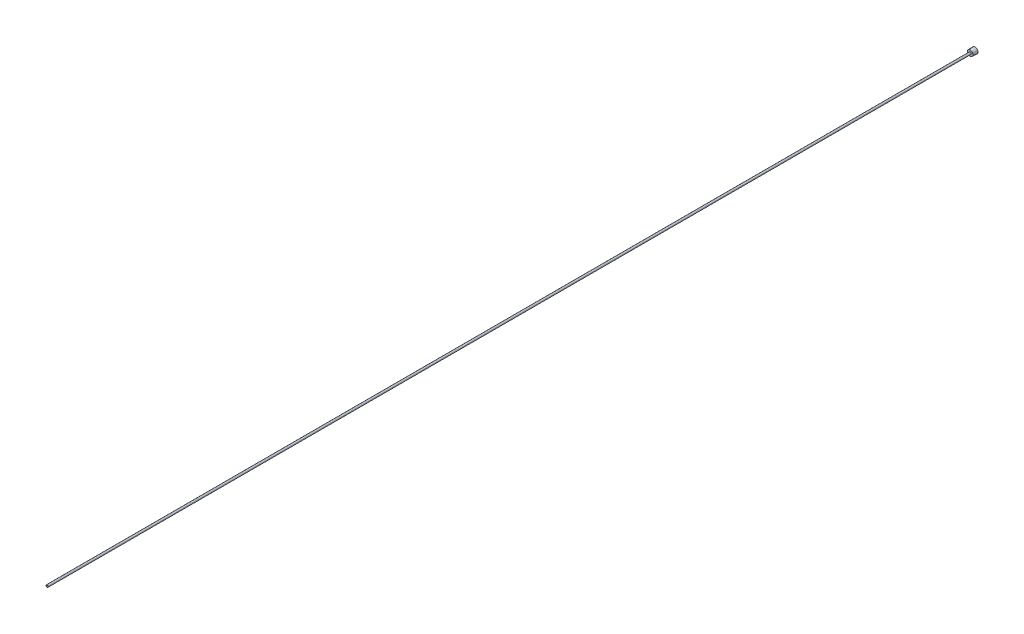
ISO-10303-21;
HEADER;
FILE_DESCRIPTION(('STEP AP214'),'2;1');
FILE_NAME('part.step','',(''),(''),'','','');
FILE_SCHEMA(('AUTOMOTIVE_DESIGN { 1 0 10303 214 1 1 1 1 }'));
ENDSEC;
DATA;
#1=APPLICATION_CONTEXT('core data for automotive mechanical design processes');
#2=APPLICATION_PROTOCOL_DEFINITION('international standard','automotive_design',2000,#1);
#3=PRODUCT_CONTEXT('',#1,'mechanical');
#4=PRODUCT('Part','Part','',(#3));
#5=PRODUCT_RELATED_PRODUCT_CATEGORY('part','',(#4));
#6=PRODUCT_DEFINITION_FORMATION('','',#4);
#7=PRODUCT_DEFINITION_CONTEXT('part definition',#1,'design');
#8=PRODUCT_DEFINITION('design','',#6,#7);
#9=PRODUCT_DEFINITION_SHAPE('','',#8);
#10=(LENGTH_UNIT() NAMED_UNIT(*) SI_UNIT(.MILLI.,.METRE.));
#11=(NAMED_UNIT(*) PLANE_ANGLE_UNIT() SI_UNIT($,.RADIAN.));
#12=(NAMED_UNIT(*) SI_UNIT($,.STERADIAN.) SOLID_ANGLE_UNIT());
#13=UNCERTAINTY_MEASURE_WITH_UNIT(LENGTH_MEASURE(1.E-05),#10,'distance_accuracy_value','');
#14=(GEOMETRIC_REPRESENTATION_CONTEXT(3) GLOBAL_UNCERTAINTY_ASSIGNED_CONTEXT((#13)) GLOBAL_UNIT_ASSIGNED_CONTEXT((#10,
#11,#12)) REPRESENTATION_CONTEXT('',''));
#15=CARTESIAN_POINT('',(0.,0.,0.));
#16=DIRECTION('',(0.,0.,1.));
#17=DIRECTION('',(1.,0.,0.));
#18=AXIS2_PLACEMENT_3D('',#15,#16,#17);
#19=CARTESIAN_POINT('',(0.,0.,0.));
#20=DIRECTION('',(0.,0.,1.));
#21=DIRECTION('',(1.,0.,0.));
#22=AXIS2_PLACEMENT_3D('',#19,#20,#21);
#23=CYLINDRICAL_SURFACE('',#22,1.2065);
#24=CARTESIAN_POINT('',(0.,0.,1219.2));
#25=DIRECTION('',(0.,0.,1.));
#26=DIRECTION('',(1.,0.,0.));
#27=AXIS2_PLACEMENT_3D('',#24,#25,#26);
#28=CIRCLE('',#27,1.2065);
#29=CARTESIAN_POINT('',(1.2065,0.,1219.2));
#30=VERTEX_POINT('',#29);
#31=EDGE_CURVE('E142',#30,#30,#28,.T.);
#32=CARTESIAN_POINT('',(0.,0.,3.96875));
#33=DIRECTION('',(0.,0.,-1.));
#34=DIRECTION('',(-1.,0.,0.));
#35=AXIS2_PLACEMENT_3D('',#32,#33,#34);
#36=CIRCLE('',#35,1.2065);
#37=CARTESIAN_POINT('',(1.2065,0.,3.96875));
#38=VERTEX_POINT('',#37);
#39=EDGE_CURVE('E37',#38,#38,#36,.F.);
#40=CARTESIAN_POINT('',(1.2065,0.,1219.2));
#41=CARTESIAN_POINT('',(1.2065,0.,1206.54134114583));
#42=CARTESIAN_POINT('',(1.2065,0.,1193.88268229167));
#43=CARTESIAN_POINT('',(1.2065,0.,1168.56536458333));
#44=CARTESIAN_POINT('',(1.2065,0.,1155.90670572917));
#45=CARTESIAN_POINT('',(1.2065,0.,1130.58938802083));
#46=CARTESIAN_POINT('',(1.2065,0.,1117.93072916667));
#47=CARTESIAN_POINT('',(1.2065,0.,1092.61341145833));
#48=CARTESIAN_POINT('',(1.2065,0.,1079.95475260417));
#49=CARTESIAN_POINT('',(1.2065,0.,1054.63743489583));
#50=CARTESIAN_POINT('',(1.2065,0.,1041.97877604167));
#51=CARTESIAN_POINT('',(1.2065,0.,1016.66145833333));
#52=CARTESIAN_POINT('',(1.2065,0.,1004.00279947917));
#53=CARTESIAN_POINT('',(1.2065,0.,978.685481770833));
#54=CARTESIAN_POINT('',(1.2065,0.,966.026822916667));
#55=CARTESIAN_POINT('',(1.2065,0.,940.709505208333));
#56=CARTESIAN_POINT('',(1.2065,0.,928.050846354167));
#57=CARTESIAN_POINT('',(1.2065,0.,902.733528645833));
#58=CARTESIAN_POINT('',(1.2065,0.,890.074869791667));
#59=CARTESIAN_POINT('',(1.2065,0.,864.757552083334));
#60=CARTESIAN_POINT('',(1.2065,0.,852.098893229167));
#61=CARTESIAN_POINT('',(1.2065,0.,826.781575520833));
#62=CARTESIAN_POINT('',(1.2065,0.,814.122916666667));
#63=CARTESIAN_POINT('',(1.2065,0.,788.805598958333));
#64=CARTESIAN_POINT('',(1.2065,0.,776.146940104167));
#65=CARTESIAN_POINT('',(1.2065,0.,750.829622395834));
#66=CARTESIAN_POINT('',(1.2065,0.,738.170963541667));
#67=CARTESIAN_POINT('',(1.2065,0.,712.853645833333));
#68=CARTESIAN_POINT('',(1.2065,0.,700.194986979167));
#69=CARTESIAN_POINT('',(1.2065,0.,674.877669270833));
#70=CARTESIAN_POINT('',(1.2065,0.,662.219010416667));
#71=CARTESIAN_POINT('',(1.2065,0.,636.901692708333));
#72=CARTESIAN_POINT('',(1.2065,0.,624.243033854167));
#73=CARTESIAN_POINT('',(1.2065,0.,598.925716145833));
#74=CARTESIAN_POINT('',(1.2065,0.,586.267057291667));
#75=CARTESIAN_POINT('',(1.2065,0.,560.949739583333));
#76=CARTESIAN_POINT('',(1.2065,0.,548.291080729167));
#77=CARTESIAN_POINT('',(1.2065,0.,522.973763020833));
#78=CARTESIAN_POINT('',(1.2065,0.,510.315104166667));
#79=CARTESIAN_POINT('',(1.2065,0.,484.997786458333));
#80=CARTESIAN_POINT('',(1.2065,0.,472.339127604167));
#81=CARTESIAN_POINT('',(1.2065,0.,447.021809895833));
#82=CARTESIAN_POINT('',(1.2065,0.,434.363151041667));
#83=CARTESIAN_POINT('',(1.2065,0.,409.045833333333));
#84=CARTESIAN_POINT('',(1.2065,0.,396.387174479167));
#85=CARTESIAN_POINT('',(1.2065,0.,371.069856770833));
#86=CARTESIAN_POINT('',(1.2065,0.,358.411197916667));
#87=CARTESIAN_POINT('',(1.2065,0.,333.093880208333));
#88=CARTESIAN_POINT('',(1.2065,0.,320.435221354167));
#89=CARTESIAN_POINT('',(1.2065,0.,295.117903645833));
#90=CARTESIAN_POINT('',(1.2065,0.,282.459244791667));
#91=CARTESIAN_POINT('',(1.2065,0.,257.141927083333));
#92=CARTESIAN_POINT('',(1.2065,0.,244.483268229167));
#93=CARTESIAN_POINT('',(1.2065,0.,219.165950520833));
#94=CARTESIAN_POINT('',(1.2065,0.,206.507291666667));
#95=CARTESIAN_POINT('',(1.2065,0.,181.189973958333));
#96=CARTESIAN_POINT('',(1.2065,0.,168.531315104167));
#97=CARTESIAN_POINT('',(1.2065,0.,143.213997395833));
#98=CARTESIAN_POINT('',(1.2065,0.,130.555338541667));
#99=CARTESIAN_POINT('',(1.2065,0.,105.238020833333));
#100=CARTESIAN_POINT('',(1.2065,0.,92.5793619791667));
#101=CARTESIAN_POINT('',(1.2065,0.,67.2620442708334));
#102=CARTESIAN_POINT('',(1.2065,0.,54.6033854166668));
#103=CARTESIAN_POINT('',(1.2065,0.,29.2860677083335));
#104=CARTESIAN_POINT('',(1.2065,0.,16.6274088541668));
#105=CARTESIAN_POINT('',(1.2065,0.,3.96875000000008));
#106=B_SPLINE_CURVE_WITH_KNOTS('',3,(#40,#41,#42,#43,#44,#45,#46,#47,#48,#49,#50,#51,#52,#53,
#54,#55,#56,#57,#58,#59,#60,#61,#62,#63,#64,#65,#66,#67,#68,#69,#70,#71,#72,#73,#74,#75,#76,#77,
#78,#79,#80,#81,#82,#83,#84,#85,#86,#87,#88,#89,#90,#91,#92,#93,#94,#95,#96,#97,#98,#99,#100,
#101,#102,#103,#104,#105),.UNSPECIFIED.,.F.,.F.,(4,2,2,2,2,2,2,2,2,2,2,2,2,2,2,2,2,2,2,2,2,2,2,
2,2,2,2,2,2,2,2,2,4),(0.,37.9759765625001,75.9519531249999,113.9279296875,151.90390625,
189.8798828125,227.855859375,265.8318359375,303.8078125,341.7837890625,379.759765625,
417.7357421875,455.71171875,493.6876953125,531.663671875,569.6396484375,607.615625,
645.5916015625,683.567578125,721.5435546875,759.51953125,797.4955078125,835.471484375,
873.4474609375,911.4234375,949.3994140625,987.375390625,1025.3513671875,1063.32734375,
1101.3033203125,1139.279296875,1177.2552734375,1215.23125),.UNSPECIFIED.);
#107=EDGE_CURVE('BSEAM33',#30,#38,#106,.T.);
#108=ORIENTED_EDGE('',*,*,#31,.T.);
#109=ORIENTED_EDGE('',*,*,#39,.F.);
#110=ORIENTED_EDGE('',*,*,#107,.T.);
#111=ORIENTED_EDGE('',*,*,#107,.F.);
#112=EDGE_LOOP('',(#108,#110,#109,#111));
#113=FACE_BOUND('',#112,.T.);
#114=ADVANCED_FACE('F33',(#113),#23,.F.);
#115=CARTESIAN_POINT('',(0.,0.,0.));
#116=DIRECTION('',(0.,0.,1.));
#117=DIRECTION('',(1.,0.,0.));
#118=AXIS2_PLACEMENT_3D('',#115,#116,#117);
#119=PLANE('',#118);
#120=DIRECTION('',(-0.866025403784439,0.5,0.));
#121=VECTOR('',#120,1.);
#122=CARTESIAN_POINT('',(0.,-2.7569630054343,0.));
#123=LINE('',#122,#121);
#124=CARTESIAN_POINT('',(0.,-2.7569630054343,0.));
#125=VERTEX_POINT('',#124);
#126=CARTESIAN_POINT('',(-2.3876,-1.37848150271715,0.));
#127=VERTEX_POINT('',#126);
#128=EDGE_CURVE('E124',#125,#127,#123,.T.);
#129=ORIENTED_EDGE('',*,*,#128,.F.);
#130=DIRECTION('',(-0.866025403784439,-0.5,0.));
#131=VECTOR('',#130,1.);
#132=CARTESIAN_POINT('',(2.3876,-1.37848150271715,0.));
#133=LINE('',#132,#131);
#134=CARTESIAN_POINT('',(2.3876,-1.37848150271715,0.));
#135=VERTEX_POINT('',#134);
#136=EDGE_CURVE('E49',#135,#125,#133,.T.);
#137=ORIENTED_EDGE('',*,*,#136,.F.);
#138=DIRECTION('',(0.,-1.,0.));
#139=VECTOR('',#138,1.);
#140=CARTESIAN_POINT('',(2.3876,1.37848150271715,0.));
#141=LINE('',#140,#139);
#142=CARTESIAN_POINT('',(2.3876,1.37848150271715,0.));
#143=VERTEX_POINT('',#142);
#144=EDGE_CURVE('E133',#143,#135,#141,.T.);
#145=ORIENTED_EDGE('',*,*,#144,.F.);
#146=DIRECTION('',(0.866025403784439,-0.5,0.));
#147=VECTOR('',#146,1.);
#148=CARTESIAN_POINT('',(0.,2.7569630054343,0.));
#149=LINE('',#148,#147);
#150=CARTESIAN_POINT('',(0.,2.7569630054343,0.));
#151=VERTEX_POINT('',#150);
#152=EDGE_CURVE('E131',#151,#143,#149,.T.);
#153=ORIENTED_EDGE('',*,*,#152,.F.);
#154=DIRECTION('',(0.866025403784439,0.5,0.));
#155=VECTOR('',#154,1.);
#156=CARTESIAN_POINT('',(-2.3876,1.37848150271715,0.));
#157=LINE('',#156,#155);
#158=CARTESIAN_POINT('',(-2.3876,1.37848150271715,0.));
#159=VERTEX_POINT('',#158);
#160=EDGE_CURVE('E97',#159,#151,#157,.T.);
#161=ORIENTED_EDGE('',*,*,#160,.F.);
#162=DIRECTION('',(0.,1.,0.));
#163=VECTOR('',#162,1.);
#164=CARTESIAN_POINT('',(-2.3876,-1.37848150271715,0.));
#165=LINE('',#164,#163);
#166=EDGE_CURVE('E127',#127,#159,#165,.T.);
#167=ORIENTED_EDGE('',*,*,#166,.F.);
#168=EDGE_LOOP('',(#129,#137,#145,#153,#161,#167));
#169=FACE_BOUND('',#168,.T.);
#170=CARTESIAN_POINT('',(0.,0.,0.));
#171=DIRECTION('',(0.,0.,1.));
#172=DIRECTION('',(1.,0.,0.));
#173=AXIS2_PLACEMENT_3D('',#170,#171,#172);
#174=CIRCLE('',#173,3.8989);
#175=CARTESIAN_POINT('',(3.8989,0.,0.));
#176=VERTEX_POINT('',#175);
#177=EDGE_CURVE('E11',#176,#176,#174,.T.);
#178=ORIENTED_EDGE('',*,*,#177,.F.);
#179=EDGE_LOOP('',(#178));
#180=FACE_BOUND('',#179,.T.);
#181=ADVANCED_FACE('F35',(#169,#180),#119,.F.);
#182=CARTESIAN_POINT('',(0.,0.,0.));
#183=DIRECTION('',(0.,0.,-1.));
#184=DIRECTION('',(-1.,0.,0.));
#185=AXIS2_PLACEMENT_3D('',#182,#183,#184);
#186=CONICAL_SURFACE('',#185,3.8989,0.0364424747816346);
#187=CARTESIAN_POINT('',(0.,0.,6.35));
#188=DIRECTION('',(0.,0.,1.));
#189=DIRECTION('',(1.,0.,0.));
#190=AXIS2_PLACEMENT_3D('',#187,#188,#189);
#191=CIRCLE('',#190,3.66738778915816);
#192=CARTESIAN_POINT('',(3.66738778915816,0.,6.35));
#193=VERTEX_POINT('',#192);
#194=EDGE_CURVE('E42',#193,#193,#191,.T.);
#195=ORIENTED_EDGE('',*,*,#194,.F.);
#196=EDGE_LOOP('',(#195));
#197=FACE_BOUND('',#196,.T.);
#198=ORIENTED_EDGE('',*,*,#177,.T.);
#199=EDGE_LOOP('',(#198));
#200=FACE_BOUND('',#199,.T.);
#201=ADVANCED_FACE('F156',(#197,#200),#186,.T.);
#202=CARTESIAN_POINT('',(0.,3.66738778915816,6.35));
#203=DIRECTION('',(0.,0.,-1.));
#204=DIRECTION('',(-1.,0.,0.));
#205=AXIS2_PLACEMENT_3D('',#202,#203,#204);
#206=PLANE('',#205);
#207=CARTESIAN_POINT('',(0.,0.,6.35));
#208=DIRECTION('',(0.,0.,1.));
#209=DIRECTION('',(1.,0.,0.));
#210=AXIS2_PLACEMENT_3D('',#207,#208,#209);
#211=CIRCLE('',#210,1.3890625);
#212=CARTESIAN_POINT('',(1.3890625,0.,6.35));
#213=VERTEX_POINT('',#212);
#214=EDGE_CURVE('E148',#213,#213,#211,.T.);
#215=ORIENTED_EDGE('',*,*,#214,.F.);
#216=EDGE_LOOP('',(#215));
#217=FACE_BOUND('',#216,.T.);
#218=ORIENTED_EDGE('',*,*,#194,.T.);
#219=EDGE_LOOP('',(#218));
#220=FACE_BOUND('',#219,.T.);
#221=ADVANCED_FACE('F154',(#217,#220),#206,.F.);
#222=CARTESIAN_POINT('',(0.,0.,0.));
#223=DIRECTION('',(0.,0.,1.));
#224=DIRECTION('',(1.,0.,0.));
#225=AXIS2_PLACEMENT_3D('',#222,#223,#224);
#226=CYLINDRICAL_SURFACE('',#225,1.38906249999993);
#227=CARTESIAN_POINT('',(0.,0.,1219.2));
#228=DIRECTION('',(0.,0.,1.));
#229=DIRECTION('',(1.,0.,0.));
#230=AXIS2_PLACEMENT_3D('',#227,#228,#229);
#231=CIRCLE('',#230,1.38906249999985);
#232=CARTESIAN_POINT('',(1.38906249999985,0.,1219.2));
#233=VERTEX_POINT('',#232);
#234=EDGE_CURVE('E145',#233,#233,#231,.T.);
#235=ORIENTED_EDGE('',*,*,#234,.F.);
#236=EDGE_LOOP('',(#235));
#237=FACE_BOUND('',#236,.T.);
#238=ORIENTED_EDGE('',*,*,#214,.T.);
#239=EDGE_LOOP('',(#238));
#240=FACE_BOUND('',#239,.T.);
#241=ADVANCED_FACE('F190',(#237,#240),#226,.T.);
#242=CARTESIAN_POINT('',(0.,1.38906249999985,1219.2));
#243=DIRECTION('',(0.,0.,-1.));
#244=DIRECTION('',(-1.,0.,0.));
#245=AXIS2_PLACEMENT_3D('',#242,#243,#244);
#246=PLANE('',#245);
#247=ORIENTED_EDGE('',*,*,#31,.F.);
#248=EDGE_LOOP('',(#247));
#249=FACE_BOUND('',#248,.T.);
#250=ORIENTED_EDGE('',*,*,#234,.T.);
#251=EDGE_LOOP('',(#250));
#252=FACE_BOUND('',#251,.T.);
#253=ADVANCED_FACE('F183',(#249,#252),#246,.F.);
#254=CARTESIAN_POINT('',(0.,-2.7569630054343,3.96875));
#255=DIRECTION('',(0.,0.,-1.));
#256=DIRECTION('',(-1.,0.,0.));
#257=AXIS2_PLACEMENT_3D('',#254,#255,#256);
#258=PLANE('',#257);
#259=DIRECTION('',(-0.866025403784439,-0.5,0.));
#260=VECTOR('',#259,1.);
#261=CARTESIAN_POINT('',(2.3876,-1.37848150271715,3.96875));
#262=LINE('',#261,#260);
#263=CARTESIAN_POINT('',(2.3876,-1.37848150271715,3.96875));
#264=VERTEX_POINT('',#263);
#265=CARTESIAN_POINT('',(0.,-2.7569630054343,3.96875));
#266=VERTEX_POINT('',#265);
#267=EDGE_CURVE('E135',#264,#266,#262,.T.);
#268=ORIENTED_EDGE('',*,*,#267,.T.);
#269=DIRECTION('',(-0.866025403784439,0.5,0.));
#270=VECTOR('',#269,1.);
#271=CARTESIAN_POINT('',(0.,-2.7569630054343,3.96875));
#272=LINE('',#271,#270);
#273=CARTESIAN_POINT('',(-2.3876,-1.37848150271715,3.96875));
#274=VERTEX_POINT('',#273);
#275=EDGE_CURVE('E118',#266,#274,#272,.T.);
#276=ORIENTED_EDGE('',*,*,#275,.T.);
#277=DIRECTION('',(0.,1.,0.));
#278=VECTOR('',#277,1.);
#279=CARTESIAN_POINT('',(-2.3876,-1.37848150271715,3.96875));
#280=LINE('',#279,#278);
#281=CARTESIAN_POINT('',(-2.3876,1.37848150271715,3.96875));
#282=VERTEX_POINT('',#281);
#283=EDGE_CURVE('E116',#274,#282,#280,.T.);
#284=ORIENTED_EDGE('',*,*,#283,.T.);
#285=DIRECTION('',(0.866025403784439,0.5,0.));
#286=VECTOR('',#285,1.);
#287=CARTESIAN_POINT('',(-2.3876,1.37848150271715,3.96875));
#288=LINE('',#287,#286);
#289=CARTESIAN_POINT('',(0.,2.7569630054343,3.96875));
#290=VERTEX_POINT('',#289);
#291=EDGE_CURVE('E94',#282,#290,#288,.T.);
#292=ORIENTED_EDGE('',*,*,#291,.T.);
#293=DIRECTION('',(0.866025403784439,-0.5,0.));
#294=VECTOR('',#293,1.);
#295=CARTESIAN_POINT('',(0.,2.7569630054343,3.96875));
#296=LINE('',#295,#294);
#297=CARTESIAN_POINT('',(2.3876,1.37848150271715,3.96875));
#298=VERTEX_POINT('',#297);
#299=EDGE_CURVE('E105',#290,#298,#296,.T.);
#300=ORIENTED_EDGE('',*,*,#299,.T.);
#301=DIRECTION('',(0.,-1.,0.));
#302=VECTOR('',#301,1.);
#303=CARTESIAN_POINT('',(2.3876,1.37848150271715,3.96875));
#304=LINE('',#303,#302);
#305=EDGE_CURVE('E109',#298,#264,#304,.T.);
#306=ORIENTED_EDGE('',*,*,#305,.T.);
#307=EDGE_LOOP('',(#268,#276,#284,#292,#300,#306));
#308=FACE_BOUND('',#307,.T.);
#309=ORIENTED_EDGE('',*,*,#39,.T.);
#310=EDGE_LOOP('',(#309));
#311=FACE_BOUND('',#310,.T.);
#312=ADVANCED_FACE('F112',(#308,#311),#258,.T.);
#313=CARTESIAN_POINT('',(2.3876,-1.37848150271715,3.96875));
#314=DIRECTION('',(0.5,-0.866025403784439,0.));
#315=DIRECTION('',(0.866025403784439,0.5,0.));
#316=AXIS2_PLACEMENT_3D('',#313,#314,#315);
#317=PLANE('',#316);
#318=ORIENTED_EDGE('',*,*,#136,.T.);
#319=DIRECTION('',(0.,0.,-1.));
#320=VECTOR('',#319,1.);
#321=CARTESIAN_POINT('',(0.,-2.7569630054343,3.96875));
#322=LINE('',#321,#320);
#323=EDGE_CURVE('E79',#266,#125,#322,.T.);
#324=ORIENTED_EDGE('',*,*,#323,.F.);
#325=ORIENTED_EDGE('',*,*,#267,.F.);
#326=DIRECTION('',(0.,0.,-1.));
#327=VECTOR('',#326,1.);
#328=CARTESIAN_POINT('',(2.3876,-1.37848150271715,3.96875));
#329=LINE('',#328,#327);
#330=EDGE_CURVE('E57',#264,#135,#329,.T.);
#331=ORIENTED_EDGE('',*,*,#330,.T.);
#332=EDGE_LOOP('',(#318,#324,#325,#331));
#333=FACE_BOUND('',#332,.T.);
#334=ADVANCED_FACE('F174',(#333),#317,.F.);
#335=CARTESIAN_POINT('',(2.3876,1.37848150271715,3.96875));
#336=DIRECTION('',(1.,0.,0.));
#337=DIRECTION('',(0.,0.,-1.));
#338=AXIS2_PLACEMENT_3D('',#335,#336,#337);
#339=PLANE('',#338);
#340=ORIENTED_EDGE('',*,*,#144,.T.);
#341=ORIENTED_EDGE('',*,*,#330,.F.);
#342=ORIENTED_EDGE('',*,*,#305,.F.);
#343=DIRECTION('',(0.,0.,-1.));
#344=VECTOR('',#343,1.);
#345=CARTESIAN_POINT('',(2.3876,1.37848150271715,3.96875));
#346=LINE('',#345,#344);
#347=EDGE_CURVE('E101',#298,#143,#346,.T.);
#348=ORIENTED_EDGE('',*,*,#347,.T.);
#349=EDGE_LOOP('',(#340,#341,#342,#348));
#350=FACE_BOUND('',#349,.T.);
#351=ADVANCED_FACE('F176',(#350),#339,.F.);
#352=CARTESIAN_POINT('',(0.,2.7569630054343,3.96875));
#353=DIRECTION('',(0.5,0.866025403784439,0.));
#354=DIRECTION('',(-0.866025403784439,0.5,0.));
#355=AXIS2_PLACEMENT_3D('',#352,#353,#354);
#356=PLANE('',#355);
#357=ORIENTED_EDGE('',*,*,#152,.T.);
#358=ORIENTED_EDGE('',*,*,#347,.F.);
#359=ORIENTED_EDGE('',*,*,#299,.F.);
#360=DIRECTION('',(0.,0.,-1.));
#361=VECTOR('',#360,1.);
#362=CARTESIAN_POINT('',(0.,2.7569630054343,3.96875));
#363=LINE('',#362,#361);
#364=EDGE_CURVE('E90',#290,#151,#363,.T.);
#365=ORIENTED_EDGE('',*,*,#364,.T.);
#366=EDGE_LOOP('',(#357,#358,#359,#365));
#367=FACE_BOUND('',#366,.T.);
#368=ADVANCED_FACE('F106',(#367),#356,.F.);
#369=CARTESIAN_POINT('',(-2.3876,1.37848150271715,3.96875));
#370=DIRECTION('',(-0.5,0.866025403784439,0.));
#371=DIRECTION('',(-0.866025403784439,-0.5,0.));
#372=AXIS2_PLACEMENT_3D('',#369,#370,#371);
#373=PLANE('',#372);
#374=ORIENTED_EDGE('',*,*,#160,.T.);
#375=ORIENTED_EDGE('',*,*,#364,.F.);
#376=ORIENTED_EDGE('',*,*,#291,.F.);
#377=DIRECTION('',(0.,0.,-1.));
#378=VECTOR('',#377,1.);
#379=CARTESIAN_POINT('',(-2.3876,1.37848150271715,3.96875));
#380=LINE('',#379,#378);
#381=EDGE_CURVE('E102',#282,#159,#380,.T.);
#382=ORIENTED_EDGE('',*,*,#381,.T.);
#383=EDGE_LOOP('',(#374,#375,#376,#382));
#384=FACE_BOUND('',#383,.T.);
#385=ADVANCED_FACE('F92',(#384),#373,.F.);
#386=CARTESIAN_POINT('',(-2.3876,-1.37848150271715,3.96875));
#387=DIRECTION('',(-1.,0.,0.));
#388=DIRECTION('',(0.,-1.,0.));
#389=AXIS2_PLACEMENT_3D('',#386,#387,#388);
#390=PLANE('',#389);
#391=ORIENTED_EDGE('',*,*,#166,.T.);
#392=ORIENTED_EDGE('',*,*,#381,.F.);
#393=ORIENTED_EDGE('',*,*,#283,.F.);
#394=DIRECTION('',(0.,0.,-1.));
#395=VECTOR('',#394,1.);
#396=CARTESIAN_POINT('',(-2.3876,-1.37848150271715,3.96875));
#397=LINE('',#396,#395);
#398=EDGE_CURVE('E139',#274,#127,#397,.T.);
#399=ORIENTED_EDGE('',*,*,#398,.T.);
#400=EDGE_LOOP('',(#391,#392,#393,#399));
#401=FACE_BOUND('',#400,.T.);
#402=ADVANCED_FACE('F246',(#401),#390,.F.);
#403=CARTESIAN_POINT('',(0.,-2.7569630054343,3.96875));
#404=DIRECTION('',(-0.5,-0.866025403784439,0.));
#405=DIRECTION('',(0.866025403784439,-0.5,0.));
#406=AXIS2_PLACEMENT_3D('',#403,#404,#405);
#407=PLANE('',#406);
#408=ORIENTED_EDGE('',*,*,#128,.T.);
#409=ORIENTED_EDGE('',*,*,#398,.F.);
#410=ORIENTED_EDGE('',*,*,#275,.F.);
#411=ORIENTED_EDGE('',*,*,#323,.T.);
#412=EDGE_LOOP('',(#408,#409,#410,#411));
#413=FACE_BOUND('',#412,.T.);
#414=ADVANCED_FACE('F172',(#413),#407,.F.);
#415=CLOSED_SHELL('',(#114,#181,#201,#221,#241,#253,#312,#334,#351,#368,#385,#402,#414));
#416=MANIFOLD_SOLID_BREP('B2',#415);
#417=ADVANCED_BREP_SHAPE_REPRESENTATION('',(#18,#416),#14);
#418=SHAPE_DEFINITION_REPRESENTATION(#9,#417);
ENDSEC;
END-ISO-10303-21;
